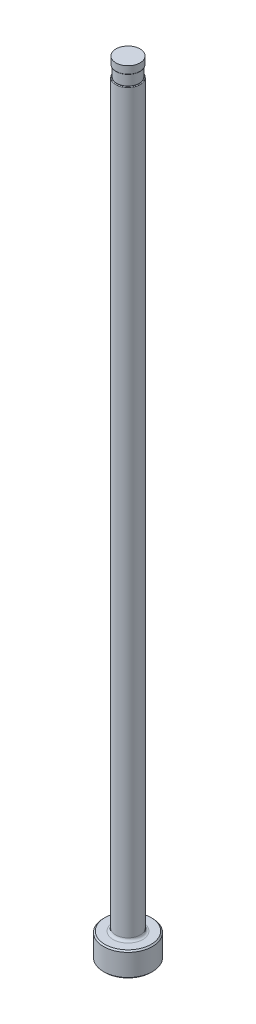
from build123d import *

# Parameters (mm, degrees)
CHAMFER1_SIZE     = 0.254
FILLET1_R         = 0.508
SKETCH2_W         = 0.2032
SKETCH2_H         = 2.032
D_SLOT_DEPTH      = 153.548755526
D_SLOT_DEPTH_BACK = 153.548755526
SKETCH5_W         = 0.0254
SKETCH5_H         = 1.524
FILLET2_R         = 0.127


with BuildPart() as part:
    # Sketch1 → Revolve1 (revolve)
    with BuildSketch(Plane.XY, mode=Mode.PRIVATE) as revolve1_sk:
        Polygon((0, 0), (-4.7625, 0), (-4.7625, 4.7498), (-2.38125, 4.7498), (-2.38125, 152.4), (0, 152.4), align=None)
    revolve(revolve1_sk.sketch.rotate(Axis((0, 259.958771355, 0), (0, -1, 0)), 270), axis=Axis((0, 259.958771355, 0), (0, -1, 0)))

    # Chamfer1
    chamfer1_edges = [part.edges().sort_by_distance(p)[0] for p in [
        (0, 4.7498, -4.7625),
        (0, 0, -4.7625),
    ]]
    chamfer(chamfer1_edges, length=CHAMFER1_SIZE)

    # Fillet1
    fillet1_edges = [part.edges().sort_by_distance(p)[0] for p in [
        (0, 4.7498, -2.38125),
    ]]
    fillet(fillet1_edges, radius=FILLET1_R)

    # Sketch2 → Vent Relief (revolve, cut)
    with BuildSketch(Plane.XY, mode=Mode.PRIVATE) as vent_relief_sk:
        with Locations((-2.27965, 149.86)):
            Rectangle(SKETCH2_W, SKETCH2_H)
    revolve(vent_relief_sk.sketch.rotate(Axis((0, 153.448281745, 0), (0, -1, 0)), 270), axis=Axis((0, 153.448281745, 0), (0, -1, 0)), mode=Mode.SUBTRACT)

    # Sketch3 → D-Slot (cut, two sides: drawn at the far end of the back side and taken through both)
    with BuildSketch(Plane.XY.offset(-D_SLOT_DEPTH_BACK)):
        with BuildLine():
            Line((-2.17805, 149.86), (-2.17805, 86.36))
            ThreePointArc((-2.17805, 86.36), (-2.229263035, 85.792038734), (-2.38125, 85.2424))
            Line((-2.38125, 85.2424), (-2.38125, 149.86))
            Line((-2.38125, 149.86), (-2.17805, 149.86))
        make_face()
    extrude(amount=D_SLOT_DEPTH + D_SLOT_DEPTH_BACK, mode=Mode.SUBTRACT)

    # Sketch5 → Vent Diameter (revolve, cut)
    with BuildSketch(Plane.XY, mode=Mode.PRIVATE) as vent_diameter_sk:
        with Locations((-2.36855, 151.638)):
            Rectangle(SKETCH5_W, SKETCH5_H)
    revolve(vent_diameter_sk.sketch.rotate(Axis((0, 152.687735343, 0), (0, -1, 0)), 90), axis=Axis((0, 152.687735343, 0), (0, -1, 0)), mode=Mode.SUBTRACT)

    # Fillet2
    fillet2_edges = [part.edges().sort_by_distance(p)[0] for p in [
        (1.995289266, 148.844, -1.299681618),
        (0, 150.876, 2.35585),
    ]]
    fillet(fillet2_edges, radius=FILLET2_R)


solid = part.part
